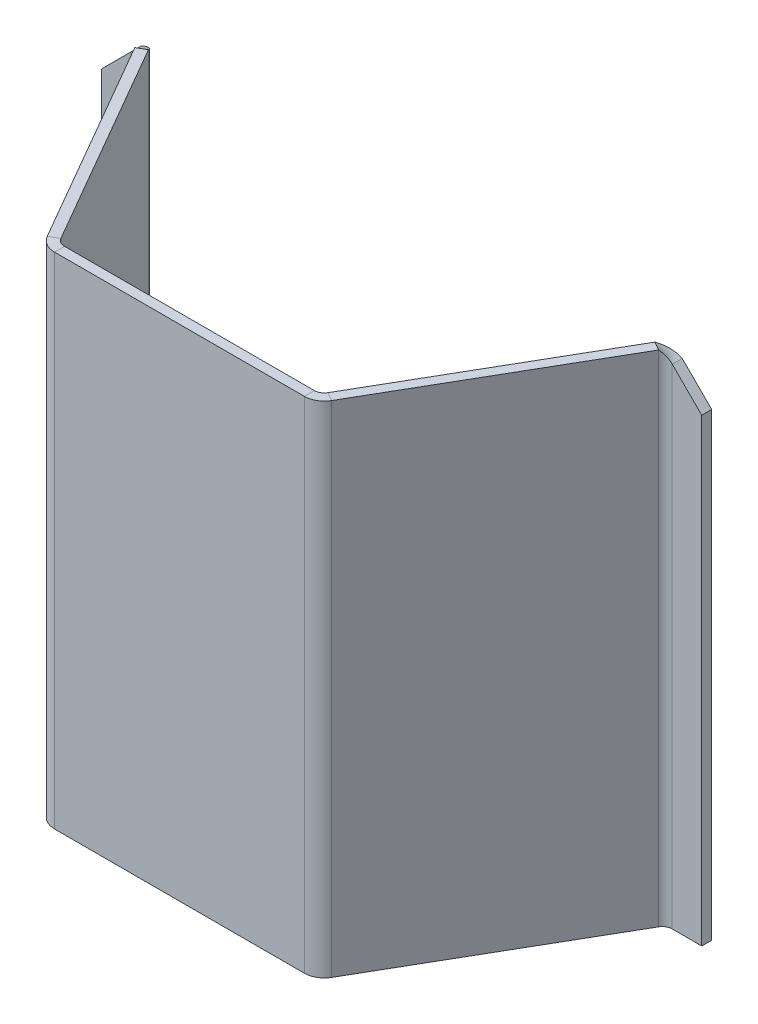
ISO-10303-21;
HEADER;
FILE_DESCRIPTION(('STEP AP214'),'2;1');
FILE_NAME('part.step','',(''),(''),'','','');
FILE_SCHEMA(('AUTOMOTIVE_DESIGN { 1 0 10303 214 1 1 1 1 }'));
ENDSEC;
DATA;
#1=APPLICATION_CONTEXT('core data for automotive mechanical design processes');
#2=APPLICATION_PROTOCOL_DEFINITION('international standard','automotive_design',2000,#1);
#3=PRODUCT_CONTEXT('',#1,'mechanical');
#4=PRODUCT('Part','Part','',(#3));
#5=PRODUCT_RELATED_PRODUCT_CATEGORY('part','',(#4));
#6=PRODUCT_DEFINITION_FORMATION('','',#4);
#7=PRODUCT_DEFINITION_CONTEXT('part definition',#1,'design');
#8=PRODUCT_DEFINITION('design','',#6,#7);
#9=PRODUCT_DEFINITION_SHAPE('','',#8);
#10=(LENGTH_UNIT() NAMED_UNIT(*) SI_UNIT(.MILLI.,.METRE.));
#11=(NAMED_UNIT(*) PLANE_ANGLE_UNIT() SI_UNIT($,.RADIAN.));
#12=(NAMED_UNIT(*) SI_UNIT($,.STERADIAN.) SOLID_ANGLE_UNIT());
#13=UNCERTAINTY_MEASURE_WITH_UNIT(LENGTH_MEASURE(1.E-05),#10,'distance_accuracy_value','');
#14=(GEOMETRIC_REPRESENTATION_CONTEXT(3) GLOBAL_UNCERTAINTY_ASSIGNED_CONTEXT((#13)) GLOBAL_UNIT_ASSIGNED_CONTEXT((#10,
#11,#12)) REPRESENTATION_CONTEXT('',''));
#15=CARTESIAN_POINT('',(0.,0.,0.));
#16=DIRECTION('',(0.,0.,1.));
#17=DIRECTION('',(1.,0.,0.));
#18=AXIS2_PLACEMENT_3D('',#15,#16,#17);
#19=CARTESIAN_POINT('',(79.,50.,1.));
#20=DIRECTION('',(0.,-1.,0.));
#21=DIRECTION('',(1.,0.,0.));
#22=AXIS2_PLACEMENT_3D('',#19,#20,#21);
#23=PLANE('',#22);
#24=DIRECTION('',(-1.,0.,0.));
#25=VECTOR('',#24,1.);
#26=CARTESIAN_POINT('',(79.,50.,0.));
#27=LINE('',#26,#25);
#28=CARTESIAN_POINT('',(54.,50.,0.));
#29=VERTEX_POINT('',#28);
#30=CARTESIAN_POINT('',(29.,50.,0.));
#31=VERTEX_POINT('',#30);
#32=EDGE_CURVE('E100',#29,#31,#27,.T.);
#33=ORIENTED_EDGE('',*,*,#32,.T.);
#34=DIRECTION('',(0.,0.,1.));
#35=VECTOR('',#34,1.);
#36=CARTESIAN_POINT('',(29.,50.,1.));
#37=LINE('',#36,#35);
#38=CARTESIAN_POINT('',(29.,50.,1.));
#39=VERTEX_POINT('',#38);
#40=EDGE_CURVE('E509',#31,#39,#37,.T.);
#41=ORIENTED_EDGE('',*,*,#40,.T.);
#42=DIRECTION('',(-1.,0.,0.));
#43=VECTOR('',#42,1.);
#44=CARTESIAN_POINT('',(79.,50.,1.));
#45=LINE('',#44,#43);
#46=CARTESIAN_POINT('',(54.,50.,0.999999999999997));
#47=VERTEX_POINT('',#46);
#48=EDGE_CURVE('E507',#47,#39,#45,.T.);
#49=ORIENTED_EDGE('',*,*,#48,.F.);
#50=DIRECTION('',(0.,0.,1.));
#51=VECTOR('',#50,1.);
#52=CARTESIAN_POINT('',(54.,50.,1.));
#53=LINE('',#52,#51);
#54=EDGE_CURVE('E510',#29,#47,#53,.T.);
#55=ORIENTED_EDGE('',*,*,#54,.F.);
#56=EDGE_LOOP('',(#33,#41,#49,#55));
#57=FACE_BOUND('',#56,.T.);
#58=ADVANCED_FACE('F75',(#57),#23,.F.);
#59=CARTESIAN_POINT('',(0.,0.,1.));
#60=DIRECTION('',(0.,1.,0.));
#61=DIRECTION('',(0.,0.,1.));
#62=AXIS2_PLACEMENT_3D('',#59,#60,#61);
#63=PLANE('',#62);
#64=DIRECTION('',(1.,0.,0.));
#65=VECTOR('',#64,1.);
#66=CARTESIAN_POINT('',(0.,0.,1.));
#67=LINE('',#66,#65);
#68=CARTESIAN_POINT('',(29.,0.,1.));
#69=VERTEX_POINT('',#68);
#70=CARTESIAN_POINT('',(54.,0.,1.));
#71=VERTEX_POINT('',#70);
#72=EDGE_CURVE('E497',#69,#71,#67,.T.);
#73=ORIENTED_EDGE('',*,*,#72,.F.);
#74=DIRECTION('',(0.,0.,-1.));
#75=VECTOR('',#74,1.);
#76=CARTESIAN_POINT('',(29.,0.,1.));
#77=LINE('',#76,#75);
#78=CARTESIAN_POINT('',(29.,0.,0.));
#79=VERTEX_POINT('',#78);
#80=EDGE_CURVE('E14',#69,#79,#77,.T.);
#81=ORIENTED_EDGE('',*,*,#80,.T.);
#82=DIRECTION('',(1.,0.,0.));
#83=VECTOR('',#82,1.);
#84=CARTESIAN_POINT('',(0.,0.,0.));
#85=LINE('',#84,#83);
#86=CARTESIAN_POINT('',(54.,0.,0.));
#87=VERTEX_POINT('',#86);
#88=EDGE_CURVE('E489',#79,#87,#85,.T.);
#89=ORIENTED_EDGE('',*,*,#88,.T.);
#90=DIRECTION('',(0.,0.,-1.));
#91=VECTOR('',#90,1.);
#92=CARTESIAN_POINT('',(54.,0.,1.));
#93=LINE('',#92,#91);
#94=EDGE_CURVE('E526',#71,#87,#93,.T.);
#95=ORIENTED_EDGE('',*,*,#94,.F.);
#96=EDGE_LOOP('',(#73,#81,#89,#95));
#97=FACE_BOUND('',#96,.T.);
#98=ADVANCED_FACE('F77',(#97),#63,.F.);
#99=CARTESIAN_POINT('',(0.,0.,0.));
#100=DIRECTION('',(0.,0.,1.));
#101=DIRECTION('',(1.,0.,0.));
#102=AXIS2_PLACEMENT_3D('',#99,#100,#101);
#103=PLANE('',#102);
#104=ORIENTED_EDGE('',*,*,#88,.F.);
#105=DIRECTION('',(0.,1.,0.));
#106=VECTOR('',#105,1.);
#107=CARTESIAN_POINT('',(29.,0.,0.));
#108=LINE('',#107,#106);
#109=EDGE_CURVE('E84',#79,#31,#108,.T.);
#110=ORIENTED_EDGE('',*,*,#109,.T.);
#111=ORIENTED_EDGE('',*,*,#32,.F.);
#112=DIRECTION('',(0.,1.,0.));
#113=VECTOR('',#112,1.);
#114=CARTESIAN_POINT('',(54.,0.,0.));
#115=LINE('',#114,#113);
#116=EDGE_CURVE('E491',#87,#29,#115,.T.);
#117=ORIENTED_EDGE('',*,*,#116,.F.);
#118=EDGE_LOOP('',(#104,#110,#111,#117));
#119=FACE_BOUND('',#118,.T.);
#120=ADVANCED_FACE('F479',(#119),#103,.F.);
#121=CARTESIAN_POINT('',(0.,0.,1.));
#122=DIRECTION('',(0.,0.,1.));
#123=DIRECTION('',(1.,0.,0.));
#124=AXIS2_PLACEMENT_3D('',#121,#122,#123);
#125=PLANE('',#124);
#126=DIRECTION('',(0.,1.,0.));
#127=VECTOR('',#126,1.);
#128=CARTESIAN_POINT('',(29.,0.,1.));
#129=LINE('',#128,#127);
#130=EDGE_CURVE('E503',#69,#39,#129,.T.);
#131=ORIENTED_EDGE('',*,*,#130,.F.);
#132=ORIENTED_EDGE('',*,*,#72,.T.);
#133=DIRECTION('',(0.,1.,0.));
#134=VECTOR('',#133,1.);
#135=CARTESIAN_POINT('',(54.,0.,1.));
#136=LINE('',#135,#134);
#137=EDGE_CURVE('E524',#71,#47,#136,.T.);
#138=ORIENTED_EDGE('',*,*,#137,.T.);
#139=ORIENTED_EDGE('',*,*,#48,.T.);
#140=EDGE_LOOP('',(#131,#132,#138,#139));
#141=FACE_BOUND('',#140,.T.);
#142=ADVANCED_FACE('F475',(#141),#125,.T.);
#143=CARTESIAN_POINT('',(54.,0.,-1.));
#144=DIRECTION('',(0.,-1.,0.));
#145=DIRECTION('',(1.,0.,0.));
#146=AXIS2_PLACEMENT_3D('',#143,#144,#145);
#147=PLANE('',#146);
#148=ORIENTED_EDGE('',*,*,#94,.T.);
#149=CARTESIAN_POINT('',(54.,0.,-1.));
#150=DIRECTION('',(0.,1.,0.));
#151=DIRECTION('',(-1.,0.,0.));
#152=AXIS2_PLACEMENT_3D('',#149,#150,#151);
#153=CIRCLE('',#152,1.);
#154=CARTESIAN_POINT('',(54.8660254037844,0.,-0.5));
#155=VERTEX_POINT('',#154);
#156=EDGE_CURVE('E438',#87,#155,#153,.T.);
#157=ORIENTED_EDGE('',*,*,#156,.T.);
#158=DIRECTION('',(-0.86602540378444,0.,-0.499999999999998));
#159=VECTOR('',#158,1.);
#160=CARTESIAN_POINT('',(55.7320508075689,0.,0.));
#161=LINE('',#160,#159);
#162=CARTESIAN_POINT('',(55.7320508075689,0.,0.));
#163=VERTEX_POINT('',#162);
#164=EDGE_CURVE('E598',#163,#155,#161,.T.);
#165=ORIENTED_EDGE('',*,*,#164,.F.);
#166=CARTESIAN_POINT('',(54.,0.,-1.));
#167=DIRECTION('',(0.,1.,0.));
#168=DIRECTION('',(-1.,0.,0.));
#169=AXIS2_PLACEMENT_3D('',#166,#167,#168);
#170=CIRCLE('',#169,2.);
#171=EDGE_CURVE('E533',#71,#163,#170,.T.);
#172=ORIENTED_EDGE('',*,*,#171,.F.);
#173=EDGE_LOOP('',(#148,#157,#165,#172));
#174=FACE_BOUND('',#173,.T.);
#175=ADVANCED_FACE('F471',(#174),#147,.T.);
#176=CARTESIAN_POINT('',(54.,50.,-1.));
#177=DIRECTION('',(0.,1.,0.));
#178=DIRECTION('',(0.,0.,1.));
#179=AXIS2_PLACEMENT_3D('',#176,#177,#178);
#180=PLANE('',#179);
#181=DIRECTION('',(0.86602540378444,0.,0.499999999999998));
#182=VECTOR('',#181,1.);
#183=CARTESIAN_POINT('',(55.7320508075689,50.,0.));
#184=LINE('',#183,#182);
#185=CARTESIAN_POINT('',(54.8660254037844,50.,-0.500000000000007));
#186=VERTEX_POINT('',#185);
#187=CARTESIAN_POINT('',(55.7320508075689,50.,0.));
#188=VERTEX_POINT('',#187);
#189=EDGE_CURVE('E431',#186,#188,#184,.T.);
#190=ORIENTED_EDGE('',*,*,#189,.F.);
#191=CARTESIAN_POINT('',(54.,50.,-1.));
#192=DIRECTION('',(0.,1.,0.));
#193=DIRECTION('',(-1.,0.,0.));
#194=AXIS2_PLACEMENT_3D('',#191,#192,#193);
#195=CIRCLE('',#194,1.);
#196=EDGE_CURVE('E530',#186,#29,#195,.F.);
#197=ORIENTED_EDGE('',*,*,#196,.T.);
#198=ORIENTED_EDGE('',*,*,#54,.T.);
#199=CARTESIAN_POINT('',(54.,50.,-1.));
#200=DIRECTION('',(0.,-1.,0.));
#201=DIRECTION('',(0.,0.,-1.));
#202=AXIS2_PLACEMENT_3D('',#199,#200,#201);
#203=CIRCLE('',#202,2.);
#204=EDGE_CURVE('E494',#188,#47,#203,.T.);
#205=ORIENTED_EDGE('',*,*,#204,.F.);
#206=EDGE_LOOP('',(#190,#197,#198,#205));
#207=FACE_BOUND('',#206,.T.);
#208=ADVANCED_FACE('F464',(#207),#180,.T.);
#209=CARTESIAN_POINT('',(54.,-25.0209620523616,-1.));
#210=DIRECTION('',(0.,1.,0.));
#211=DIRECTION('',(-1.,0.,0.));
#212=AXIS2_PLACEMENT_3D('',#209,#210,#211);
#213=CYLINDRICAL_SURFACE('',#212,2.);
#214=ORIENTED_EDGE('',*,*,#204,.T.);
#215=ORIENTED_EDGE('',*,*,#137,.F.);
#216=ORIENTED_EDGE('',*,*,#171,.T.);
#217=DIRECTION('',(0.,1.,0.));
#218=VECTOR('',#217,1.);
#219=CARTESIAN_POINT('',(55.7320508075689,0.,0.));
#220=LINE('',#219,#218);
#221=EDGE_CURVE('E335',#163,#188,#220,.T.);
#222=ORIENTED_EDGE('',*,*,#221,.T.);
#223=EDGE_LOOP('',(#214,#215,#216,#222));
#224=FACE_BOUND('',#223,.T.);
#225=ADVANCED_FACE('F460',(#224),#213,.T.);
#226=CARTESIAN_POINT('',(54.,-25.0209620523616,-1.));
#227=DIRECTION('',(0.,1.,0.));
#228=DIRECTION('',(-1.,0.,0.));
#229=AXIS2_PLACEMENT_3D('',#226,#227,#228);
#230=CYLINDRICAL_SURFACE('',#229,1.);
#231=ORIENTED_EDGE('',*,*,#196,.F.);
#232=DIRECTION('',(0.,1.,0.));
#233=VECTOR('',#232,1.);
#234=CARTESIAN_POINT('',(54.8660254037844,0.,-0.500000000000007));
#235=LINE('',#234,#233);
#236=EDGE_CURVE('E428',#155,#186,#235,.T.);
#237=ORIENTED_EDGE('',*,*,#236,.F.);
#238=ORIENTED_EDGE('',*,*,#156,.F.);
#239=ORIENTED_EDGE('',*,*,#116,.T.);
#240=EDGE_LOOP('',(#231,#237,#238,#239));
#241=FACE_BOUND('',#240,.T.);
#242=ADVANCED_FACE('F463',(#241),#230,.F.);
#243=CARTESIAN_POINT('',(71.5272641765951,0.,-21.2437263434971));
#244=DIRECTION('',(-1.,0.,0.));
#245=DIRECTION('',(0.,0.,1.));
#246=AXIS2_PLACEMENT_3D('',#243,#244,#245);
#247=PLANE('',#246);
#248=DIRECTION('',(0.,1.,0.));
#249=VECTOR('',#248,1.);
#250=CARTESIAN_POINT('',(71.5272641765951,0.,-22.2437263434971));
#251=LINE('',#250,#249);
#252=CARTESIAN_POINT('',(71.5272641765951,0.,-22.2437263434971));
#253=VERTEX_POINT('',#252);
#254=CARTESIAN_POINT('',(71.5272641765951,46.,-22.2437263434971));
#255=VERTEX_POINT('',#254);
#256=EDGE_CURVE('E541',#253,#255,#251,.T.);
#257=ORIENTED_EDGE('',*,*,#256,.T.);
#258=DIRECTION('',(0.,0.,-1.));
#259=VECTOR('',#258,1.);
#260=CARTESIAN_POINT('',(71.5272641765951,46.,-21.2437263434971));
#261=LINE('',#260,#259);
#262=CARTESIAN_POINT('',(71.5272641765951,46.,-21.2437263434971));
#263=VERTEX_POINT('',#262);
#264=EDGE_CURVE('E550',#263,#255,#261,.T.);
#265=ORIENTED_EDGE('',*,*,#264,.F.);
#266=DIRECTION('',(0.,1.,0.));
#267=VECTOR('',#266,1.);
#268=CARTESIAN_POINT('',(71.5272641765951,0.,-21.2437263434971));
#269=LINE('',#268,#267);
#270=CARTESIAN_POINT('',(71.5272641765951,0.,-21.2437263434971));
#271=VERTEX_POINT('',#270);
#272=EDGE_CURVE('E565',#271,#263,#269,.T.);
#273=ORIENTED_EDGE('',*,*,#272,.F.);
#274=DIRECTION('',(0.,0.,-1.));
#275=VECTOR('',#274,1.);
#276=CARTESIAN_POINT('',(71.5272641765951,0.,-21.2437263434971));
#277=LINE('',#276,#275);
#278=EDGE_CURVE('E543',#271,#253,#277,.T.);
#279=ORIENTED_EDGE('',*,*,#278,.T.);
#280=EDGE_LOOP('',(#257,#265,#273,#279));
#281=FACE_BOUND('',#280,.T.);
#282=ADVANCED_FACE('F361',(#281),#247,.F.);
#283=CARTESIAN_POINT('',(71.5272641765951,46.,-21.2437263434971));
#284=DIRECTION('',(-0.707106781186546,-0.707106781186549,0.));
#285=DIRECTION('',(0.707106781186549,-0.707106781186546,0.));
#286=AXIS2_PLACEMENT_3D('',#283,#284,#285);
#287=PLANE('',#286);
#288=DIRECTION('',(-0.707106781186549,0.707106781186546,0.));
#289=VECTOR('',#288,1.);
#290=CARTESIAN_POINT('',(71.5272641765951,46.,-22.2437263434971));
#291=LINE('',#290,#289);
#292=CARTESIAN_POINT('',(68.5744721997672,48.9527919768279,-22.2437263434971));
#293=VERTEX_POINT('',#292);
#294=EDGE_CURVE('E546',#255,#293,#291,.T.);
#295=ORIENTED_EDGE('',*,*,#294,.T.);
#296=CARTESIAN_POINT('',(68.5744721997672,48.9527919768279,-21.2437263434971));
#297=CARTESIAN_POINT('',(68.5744721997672,48.9527919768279,-22.2437263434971));
#298=B_SPLINE_CURVE_WITH_KNOTS('',1,(#296,#297),.UNSPECIFIED.,.F.,.F.,(2,2),(0.,1.),.UNSPECIFIED.);
#299=CARTESIAN_POINT('',(68.5744721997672,48.9527919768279,-21.2437263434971));
#300=VERTEX_POINT('',#299);
#301=EDGE_CURVE('E343',#293,#300,#298,.F.);
#302=ORIENTED_EDGE('',*,*,#301,.T.);
#303=DIRECTION('',(-0.707106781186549,0.707106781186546,0.));
#304=VECTOR('',#303,1.);
#305=CARTESIAN_POINT('',(71.5272641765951,46.,-21.2437263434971));
#306=LINE('',#305,#304);
#307=EDGE_CURVE('E421',#263,#300,#306,.T.);
#308=ORIENTED_EDGE('',*,*,#307,.F.);
#309=ORIENTED_EDGE('',*,*,#264,.T.);
#310=EDGE_LOOP('',(#295,#302,#308,#309));
#311=FACE_BOUND('',#310,.T.);
#312=ADVANCED_FACE('F350',(#311),#287,.F.);
#313=CARTESIAN_POINT('',(-11.4727358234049,0.,-22.2437263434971));
#314=DIRECTION('',(0.,0.,1.));
#315=DIRECTION('',(1.,0.,0.));
#316=AXIS2_PLACEMENT_3D('',#313,#314,#315);
#317=PLANE('',#316);
#318=DIRECTION('',(1.,0.,0.));
#319=VECTOR('',#318,1.);
#320=CARTESIAN_POINT('',(-11.4727358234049,0.,-22.2437263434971));
#321=LINE('',#320,#319);
#322=CARTESIAN_POINT('',(68.5744721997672,0.,-22.2437263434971));
#323=VERTEX_POINT('',#322);
#324=EDGE_CURVE('E561',#323,#253,#321,.T.);
#325=ORIENTED_EDGE('',*,*,#324,.F.);
#326=DIRECTION('',(0.,1.,0.));
#327=VECTOR('',#326,1.);
#328=CARTESIAN_POINT('',(68.5744721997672,0.,-22.2437263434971));
#329=LINE('',#328,#327);
#330=EDGE_CURVE('E553',#323,#293,#329,.T.);
#331=ORIENTED_EDGE('',*,*,#330,.T.);
#332=ORIENTED_EDGE('',*,*,#294,.F.);
#333=ORIENTED_EDGE('',*,*,#256,.F.);
#334=EDGE_LOOP('',(#325,#331,#332,#333));
#335=FACE_BOUND('',#334,.T.);
#336=ADVANCED_FACE('F360',(#335),#317,.F.);
#337=CARTESIAN_POINT('',(-11.4727358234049,0.,-21.2437263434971));
#338=DIRECTION('',(0.,1.,0.));
#339=DIRECTION('',(0.,0.,1.));
#340=AXIS2_PLACEMENT_3D('',#337,#338,#339);
#341=PLANE('',#340);
#342=DIRECTION('',(1.,0.,0.));
#343=VECTOR('',#342,1.);
#344=CARTESIAN_POINT('',(-11.4727358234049,0.,-21.2437263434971));
#345=LINE('',#344,#343);
#346=CARTESIAN_POINT('',(68.5744721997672,0.,-21.2437263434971));
#347=VERTEX_POINT('',#346);
#348=EDGE_CURVE('E563',#347,#271,#345,.T.);
#349=ORIENTED_EDGE('',*,*,#348,.F.);
#350=DIRECTION('',(0.,0.,-1.));
#351=VECTOR('',#350,1.);
#352=CARTESIAN_POINT('',(68.5744721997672,0.,-21.2437263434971));
#353=LINE('',#352,#351);
#354=EDGE_CURVE('E558',#347,#323,#353,.T.);
#355=ORIENTED_EDGE('',*,*,#354,.T.);
#356=ORIENTED_EDGE('',*,*,#324,.T.);
#357=ORIENTED_EDGE('',*,*,#278,.F.);
#358=EDGE_LOOP('',(#349,#355,#356,#357));
#359=FACE_BOUND('',#358,.T.);
#360=ADVANCED_FACE('F365',(#359),#341,.F.);
#361=CARTESIAN_POINT('',(-11.4727358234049,0.,-21.2437263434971));
#362=DIRECTION('',(0.,0.,1.));
#363=DIRECTION('',(1.,0.,0.));
#364=AXIS2_PLACEMENT_3D('',#361,#362,#363);
#365=PLANE('',#364);
#366=DIRECTION('',(0.,1.,0.));
#367=VECTOR('',#366,1.);
#368=CARTESIAN_POINT('',(68.5744721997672,0.,-21.2437263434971));
#369=LINE('',#368,#367);
#370=EDGE_CURVE('E583',#347,#300,#369,.T.);
#371=ORIENTED_EDGE('',*,*,#370,.F.);
#372=ORIENTED_EDGE('',*,*,#348,.T.);
#373=ORIENTED_EDGE('',*,*,#272,.T.);
#374=ORIENTED_EDGE('',*,*,#307,.T.);
#375=EDGE_LOOP('',(#371,#372,#373,#374));
#376=FACE_BOUND('',#375,.T.);
#377=ADVANCED_FACE('F369',(#376),#365,.T.);
#378=CARTESIAN_POINT('',(68.5744721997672,48.9527919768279,-22.2437263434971));
#379=CARTESIAN_POINT('',(68.2252483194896,49.1274056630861,-22.2437263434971));
#380=CARTESIAN_POINT('',(67.8767720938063,49.3018613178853,-22.1503100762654));
#381=CARTESIAN_POINT('',(67.2721723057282,49.6509306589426,-21.8012442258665));
#382=CARTESIAN_POINT('',(67.0170333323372,49.8253863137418,-21.5461630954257));
#383=CARTESIAN_POINT('',(66.8424213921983,50.,-21.2437263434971));
#384=CARTESIAN_POINT('',(68.5744721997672,48.9527919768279,-21.2437263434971));
#385=CARTESIAN_POINT('',(68.399889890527,49.1273760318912,-21.2437263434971));
#386=CARTESIAN_POINT('',(68.2256221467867,49.3018613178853,-21.1970182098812));
#387=CARTESIAN_POINT('',(67.9233222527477,49.6509306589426,-21.0224852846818));
#388=CARTESIAN_POINT('',(67.7957379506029,49.8254159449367,-20.8949190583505));
#389=CARTESIAN_POINT('',(67.7084467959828,50.,-20.7437263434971));
#390=B_SPLINE_SURFACE_WITH_KNOTS('',1,3,((#378,#379,#380,#381,#382,#383),(#384,#385,#386,#387,
#388,#389)),.UNSPECIFIED.,.F.,.F.,.F.,(2,2),(4,2,4),(0.,1.),(0.,0.5,1.),.UNSPECIFIED.);
#391=CARTESIAN_POINT('',(68.5744721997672,48.9527919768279,-22.2437263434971));
#392=CARTESIAN_POINT('',(68.2252483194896,49.1274056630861,-22.2437263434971));
#393=CARTESIAN_POINT('',(67.8767720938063,49.3018613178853,-22.1503100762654));
#394=CARTESIAN_POINT('',(67.2721723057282,49.6509306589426,-21.8012442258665));
#395=CARTESIAN_POINT('',(67.0170333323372,49.8253863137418,-21.5461630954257));
#396=CARTESIAN_POINT('',(66.8424213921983,50.,-21.2437263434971));
#397=B_SPLINE_CURVE_WITH_KNOTS('',3,(#391,#392,#393,#394,#395,#396),.UNSPECIFIED.,.F.,.F.,(4,2,
4),(0.,0.5,1.),.UNSPECIFIED.);
#398=CARTESIAN_POINT('',(66.8424213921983,50.,-21.2437263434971));
#399=VERTEX_POINT('',#398);
#400=EDGE_CURVE('E412',#293,#399,#397,.T.);
#401=CARTESIAN_POINT('',(66.8424213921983,50.,-21.2437263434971));
#402=CARTESIAN_POINT('',(67.7084467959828,50.,-20.7437263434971));
#403=B_SPLINE_CURVE_WITH_KNOTS('',1,(#401,#402),.UNSPECIFIED.,.F.,.F.,(2,2),(0.,1.),.UNSPECIFIED.);
#404=CARTESIAN_POINT('',(67.7084467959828,50.,-20.7437263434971));
#405=VERTEX_POINT('',#404);
#406=EDGE_CURVE('E416',#405,#399,#403,.F.);
#407=CARTESIAN_POINT('',(67.7084467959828,50.,-20.7437263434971));
#408=CARTESIAN_POINT('',(67.7957379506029,49.8254159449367,-20.8949190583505));
#409=CARTESIAN_POINT('',(67.9233222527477,49.6509306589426,-21.0224852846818));
#410=CARTESIAN_POINT('',(68.2256221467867,49.3018613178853,-21.1970182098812));
#411=CARTESIAN_POINT('',(68.399889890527,49.1273760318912,-21.2437263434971));
#412=CARTESIAN_POINT('',(68.5744721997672,48.9527919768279,-21.2437263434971));
#413=B_SPLINE_CURVE_WITH_KNOTS('',3,(#407,#408,#409,#410,#411,#412),.UNSPECIFIED.,.F.,.F.,(4,2,
4),(0.,0.5,1.),.UNSPECIFIED.);
#414=EDGE_CURVE('E579',#300,#405,#413,.F.);
#415=ORIENTED_EDGE('',*,*,#301,.F.);
#416=ORIENTED_EDGE('',*,*,#400,.T.);
#417=ORIENTED_EDGE('',*,*,#406,.F.);
#418=ORIENTED_EDGE('',*,*,#414,.F.);
#419=EDGE_LOOP('',(#415,#416,#417,#418));
#420=FACE_BOUND('',#419,.T.);
#421=ADVANCED_FACE('F373',(#420),#390,.F.);
#422=CARTESIAN_POINT('',(68.5744721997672,-25.0209620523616,-20.2437263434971));
#423=DIRECTION('',(0.,1.,0.));
#424=DIRECTION('',(0.86602540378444,0.,0.499999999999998));
#425=AXIS2_PLACEMENT_3D('',#422,#423,#424);
#426=CYLINDRICAL_SURFACE('',#425,2.);
#427=ORIENTED_EDGE('',*,*,#400,.F.);
#428=ORIENTED_EDGE('',*,*,#330,.F.);
#429=CARTESIAN_POINT('',(68.5744721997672,0.,-20.2437263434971));
#430=DIRECTION('',(0.,1.,0.));
#431=DIRECTION('',(0.86602540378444,0.,0.499999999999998));
#432=AXIS2_PLACEMENT_3D('',#429,#430,#431);
#433=CIRCLE('',#432,2.);
#434=CARTESIAN_POINT('',(66.8424213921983,0.,-21.2437263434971));
#435=VERTEX_POINT('',#434);
#436=EDGE_CURVE('E576',#435,#323,#433,.F.);
#437=ORIENTED_EDGE('',*,*,#436,.F.);
#438=DIRECTION('',(0.,1.,0.));
#439=VECTOR('',#438,1.);
#440=CARTESIAN_POINT('',(66.8424213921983,0.,-21.2437263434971));
#441=LINE('',#440,#439);
#442=EDGE_CURVE('E420',#435,#399,#441,.T.);
#443=ORIENTED_EDGE('',*,*,#442,.T.);
#444=EDGE_LOOP('',(#427,#428,#437,#443));
#445=FACE_BOUND('',#444,.T.);
#446=ADVANCED_FACE('F380',(#445),#426,.T.);
#447=CARTESIAN_POINT('',(68.5744721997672,0.,-20.2437263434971));
#448=DIRECTION('',(0.,1.,0.));
#449=DIRECTION('',(0.86602540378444,0.,0.499999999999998));
#450=AXIS2_PLACEMENT_3D('',#447,#448,#449);
#451=PLANE('',#450);
#452=DIRECTION('',(-0.86602540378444,0.,-0.499999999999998));
#453=VECTOR('',#452,1.);
#454=CARTESIAN_POINT('',(67.7084467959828,0.,-20.7437263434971));
#455=LINE('',#454,#453);
#456=CARTESIAN_POINT('',(67.7084467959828,0.,-20.7437263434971));
#457=VERTEX_POINT('',#456);
#458=EDGE_CURVE('E573',#457,#435,#455,.T.);
#459=ORIENTED_EDGE('',*,*,#458,.T.);
#460=ORIENTED_EDGE('',*,*,#436,.T.);
#461=ORIENTED_EDGE('',*,*,#354,.F.);
#462=CARTESIAN_POINT('',(68.5744721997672,0.,-20.2437263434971));
#463=DIRECTION('',(0.,-1.,0.));
#464=DIRECTION('',(-0.86602540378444,0.,-0.499999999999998));
#465=AXIS2_PLACEMENT_3D('',#462,#463,#464);
#466=CIRCLE('',#465,1.);
#467=EDGE_CURVE('E580',#457,#347,#466,.T.);
#468=ORIENTED_EDGE('',*,*,#467,.F.);
#469=EDGE_LOOP('',(#459,#460,#461,#468));
#470=FACE_BOUND('',#469,.T.);
#471=ADVANCED_FACE('F612',(#470),#451,.F.);
#472=CARTESIAN_POINT('',(68.5744721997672,-25.0209620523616,-20.2437263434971));
#473=DIRECTION('',(0.,1.,0.));
#474=DIRECTION('',(0.86602540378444,0.,0.499999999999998));
#475=AXIS2_PLACEMENT_3D('',#472,#473,#474);
#476=CYLINDRICAL_SURFACE('',#475,1.);
#477=ORIENTED_EDGE('',*,*,#414,.T.);
#478=DIRECTION('',(0.,1.,0.));
#479=VECTOR('',#478,1.);
#480=CARTESIAN_POINT('',(67.7084467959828,0.,-20.7437263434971));
#481=LINE('',#480,#479);
#482=EDGE_CURVE('E590',#457,#405,#481,.T.);
#483=ORIENTED_EDGE('',*,*,#482,.F.);
#484=ORIENTED_EDGE('',*,*,#467,.T.);
#485=ORIENTED_EDGE('',*,*,#370,.T.);
#486=EDGE_LOOP('',(#477,#483,#484,#485));
#487=FACE_BOUND('',#486,.T.);
#488=ADVANCED_FACE('F620',(#487),#476,.F.);
#489=CARTESIAN_POINT('',(28.2084467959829,0.,47.6722805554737));
#490=DIRECTION('',(0.86602540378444,0.,0.499999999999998));
#491=DIRECTION('',(0.499999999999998,0.,-0.86602540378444));
#492=AXIS2_PLACEMENT_3D('',#489,#490,#491);
#493=PLANE('',#492);
#494=ORIENTED_EDGE('',*,*,#221,.F.);
#495=DIRECTION('',(0.499999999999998,0.,-0.86602540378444));
#496=VECTOR('',#495,1.);
#497=CARTESIAN_POINT('',(28.2084467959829,0.,47.6722805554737));
#498=LINE('',#497,#496);
#499=EDGE_CURVE('E588',#163,#457,#498,.T.);
#500=ORIENTED_EDGE('',*,*,#499,.T.);
#501=ORIENTED_EDGE('',*,*,#482,.T.);
#502=DIRECTION('',(-0.499999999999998,0.,0.86602540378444));
#503=VECTOR('',#502,1.);
#504=CARTESIAN_POINT('',(67.7084467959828,50.,-20.7437263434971));
#505=LINE('',#504,#503);
#506=EDGE_CURVE('E437',#405,#188,#505,.T.);
#507=ORIENTED_EDGE('',*,*,#506,.T.);
#508=EDGE_LOOP('',(#494,#500,#501,#507));
#509=FACE_BOUND('',#508,.T.);
#510=ADVANCED_FACE('F622',(#509),#493,.T.);
#511=CARTESIAN_POINT('',(28.2084467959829,0.,47.6722805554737));
#512=DIRECTION('',(0.,1.,0.));
#513=DIRECTION('',(0.86602540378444,0.,0.499999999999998));
#514=AXIS2_PLACEMENT_3D('',#511,#512,#513);
#515=PLANE('',#514);
#516=ORIENTED_EDGE('',*,*,#499,.F.);
#517=ORIENTED_EDGE('',*,*,#164,.T.);
#518=DIRECTION('',(0.499999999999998,0.,-0.86602540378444));
#519=VECTOR('',#518,1.);
#520=CARTESIAN_POINT('',(27.3424213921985,0.,47.1722805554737));
#521=LINE('',#520,#519);
#522=EDGE_CURVE('E601',#155,#435,#521,.T.);
#523=ORIENTED_EDGE('',*,*,#522,.T.);
#524=ORIENTED_EDGE('',*,*,#458,.F.);
#525=EDGE_LOOP('',(#516,#517,#523,#524));
#526=FACE_BOUND('',#525,.T.);
#527=ADVANCED_FACE('F608',(#526),#515,.F.);
#528=CARTESIAN_POINT('',(27.3424213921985,0.,47.1722805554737));
#529=DIRECTION('',(0.86602540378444,0.,0.499999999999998));
#530=DIRECTION('',(0.499999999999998,0.,-0.86602540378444));
#531=AXIS2_PLACEMENT_3D('',#528,#529,#530);
#532=PLANE('',#531);
#533=ORIENTED_EDGE('',*,*,#522,.F.);
#534=ORIENTED_EDGE('',*,*,#236,.T.);
#535=DIRECTION('',(-0.499999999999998,0.,0.86602540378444));
#536=VECTOR('',#535,1.);
#537=CARTESIAN_POINT('',(66.8424213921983,50.,-21.2437263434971));
#538=LINE('',#537,#536);
#539=EDGE_CURVE('E425',#399,#186,#538,.T.);
#540=ORIENTED_EDGE('',*,*,#539,.F.);
#541=ORIENTED_EDGE('',*,*,#442,.F.);
#542=EDGE_LOOP('',(#533,#534,#540,#541));
#543=FACE_BOUND('',#542,.T.);
#544=ADVANCED_FACE('F426',(#543),#532,.F.);
#545=CARTESIAN_POINT('',(67.7084467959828,50.,-20.7437263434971));
#546=DIRECTION('',(0.,-1.,0.));
#547=DIRECTION('',(0.499999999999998,0.,-0.86602540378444));
#548=AXIS2_PLACEMENT_3D('',#545,#546,#547);
#549=PLANE('',#548);
#550=ORIENTED_EDGE('',*,*,#539,.T.);
#551=ORIENTED_EDGE('',*,*,#189,.T.);
#552=ORIENTED_EDGE('',*,*,#506,.F.);
#553=ORIENTED_EDGE('',*,*,#406,.T.);
#554=EDGE_LOOP('',(#550,#551,#552,#553));
#555=FACE_BOUND('',#554,.T.);
#556=ADVANCED_FACE('F435',(#555),#549,.F.);
#557=CARTESIAN_POINT('',(29.,0.,-1.));
#558=DIRECTION('',(0.,-1.,0.));
#559=DIRECTION('',(1.,0.,0.));
#560=AXIS2_PLACEMENT_3D('',#557,#558,#559);
#561=PLANE('',#560);
#562=DIRECTION('',(0.86602540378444,0.,-0.499999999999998));
#563=VECTOR('',#562,1.);
#564=CARTESIAN_POINT('',(27.2679491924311,0.,0.));
#565=LINE('',#564,#563);
#566=CARTESIAN_POINT('',(27.2679491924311,0.,0.));
#567=VERTEX_POINT('',#566);
#568=CARTESIAN_POINT('',(28.1339745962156,0.,-0.5));
#569=VERTEX_POINT('',#568);
#570=EDGE_CURVE('E326',#567,#569,#565,.T.);
#571=ORIENTED_EDGE('',*,*,#570,.T.);
#572=CARTESIAN_POINT('',(29.,0.,-1.));
#573=DIRECTION('',(0.,-1.,0.));
#574=DIRECTION('',(1.,0.,0.));
#575=AXIS2_PLACEMENT_3D('',#572,#573,#574);
#576=CIRCLE('',#575,1.);
#577=EDGE_CURVE('E92',#569,#79,#576,.F.);
#578=ORIENTED_EDGE('',*,*,#577,.T.);
#579=ORIENTED_EDGE('',*,*,#80,.F.);
#580=CARTESIAN_POINT('',(29.,0.,-1.));
#581=DIRECTION('',(0.,1.,0.));
#582=DIRECTION('',(-1.,0.,0.));
#583=AXIS2_PLACEMENT_3D('',#580,#581,#582);
#584=CIRCLE('',#583,2.);
#585=EDGE_CURVE('E328',#567,#69,#584,.T.);
#586=ORIENTED_EDGE('',*,*,#585,.F.);
#587=EDGE_LOOP('',(#571,#578,#579,#586));
#588=FACE_BOUND('',#587,.T.);
#589=ADVANCED_FACE('F458',(#588),#561,.T.);
#590=CARTESIAN_POINT('',(29.,50.,-1.));
#591=DIRECTION('',(0.,1.,0.));
#592=DIRECTION('',(0.,0.,1.));
#593=AXIS2_PLACEMENT_3D('',#590,#591,#592);
#594=PLANE('',#593);
#595=CARTESIAN_POINT('',(29.,50.,-1.));
#596=DIRECTION('',(0.,-1.,0.));
#597=DIRECTION('',(1.,0.,0.));
#598=AXIS2_PLACEMENT_3D('',#595,#596,#597);
#599=CIRCLE('',#598,1.);
#600=CARTESIAN_POINT('',(28.1339745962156,50.,-0.5));
#601=VERTEX_POINT('',#600);
#602=EDGE_CURVE('E332',#31,#601,#599,.T.);
#603=ORIENTED_EDGE('',*,*,#602,.T.);
#604=DIRECTION('',(-0.86602540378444,0.,0.499999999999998));
#605=VECTOR('',#604,1.);
#606=CARTESIAN_POINT('',(27.2679491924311,50.,0.));
#607=LINE('',#606,#605);
#608=CARTESIAN_POINT('',(27.2679491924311,50.,0.));
#609=VERTEX_POINT('',#608);
#610=EDGE_CURVE('E224',#601,#609,#607,.T.);
#611=ORIENTED_EDGE('',*,*,#610,.T.);
#612=CARTESIAN_POINT('',(29.,50.,-1.));
#613=DIRECTION('',(0.,-1.,0.));
#614=DIRECTION('',(0.,0.,-1.));
#615=AXIS2_PLACEMENT_3D('',#612,#613,#614);
#616=CIRCLE('',#615,2.);
#617=EDGE_CURVE('E331',#39,#609,#616,.T.);
#618=ORIENTED_EDGE('',*,*,#617,.F.);
#619=ORIENTED_EDGE('',*,*,#40,.F.);
#620=EDGE_LOOP('',(#603,#611,#618,#619));
#621=FACE_BOUND('',#620,.T.);
#622=ADVANCED_FACE('F628',(#621),#594,.T.);
#623=CARTESIAN_POINT('',(29.,75.0209620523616,-1.));
#624=DIRECTION('',(0.,-1.,0.));
#625=DIRECTION('',(1.,0.,0.));
#626=AXIS2_PLACEMENT_3D('',#623,#624,#625);
#627=CYLINDRICAL_SURFACE('',#626,2.);
#628=ORIENTED_EDGE('',*,*,#130,.T.);
#629=ORIENTED_EDGE('',*,*,#617,.T.);
#630=DIRECTION('',(0.,1.,0.));
#631=VECTOR('',#630,1.);
#632=CARTESIAN_POINT('',(27.2679491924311,0.,0.));
#633=LINE('',#632,#631);
#634=EDGE_CURVE('E272',#567,#609,#633,.T.);
#635=ORIENTED_EDGE('',*,*,#634,.F.);
#636=ORIENTED_EDGE('',*,*,#585,.T.);
#637=EDGE_LOOP('',(#628,#629,#635,#636));
#638=FACE_BOUND('',#637,.T.);
#639=ADVANCED_FACE('F502',(#638),#627,.T.);
#640=CARTESIAN_POINT('',(29.,75.0209620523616,-1.));
#641=DIRECTION('',(0.,-1.,0.));
#642=DIRECTION('',(1.,0.,0.));
#643=AXIS2_PLACEMENT_3D('',#640,#641,#642);
#644=CYLINDRICAL_SURFACE('',#643,1.);
#645=ORIENTED_EDGE('',*,*,#109,.F.);
#646=ORIENTED_EDGE('',*,*,#577,.F.);
#647=DIRECTION('',(0.,1.,0.));
#648=VECTOR('',#647,1.);
#649=CARTESIAN_POINT('',(28.1339745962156,0.,-0.5));
#650=LINE('',#649,#648);
#651=EDGE_CURVE('E324',#569,#601,#650,.T.);
#652=ORIENTED_EDGE('',*,*,#651,.T.);
#653=ORIENTED_EDGE('',*,*,#602,.F.);
#654=EDGE_LOOP('',(#645,#646,#652,#653));
#655=FACE_BOUND('',#654,.T.);
#656=ADVANCED_FACE('F630',(#655),#644,.F.);
#657=CARTESIAN_POINT('',(11.4727358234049,46.,-21.2437263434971));
#658=DIRECTION('',(1.,0.,0.));
#659=DIRECTION('',(0.,1.,0.));
#660=AXIS2_PLACEMENT_3D('',#657,#658,#659);
#661=PLANE('',#660);
#662=DIRECTION('',(0.,-1.,0.));
#663=VECTOR('',#662,1.);
#664=CARTESIAN_POINT('',(11.4727358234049,46.,-22.2437263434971));
#665=LINE('',#664,#663);
#666=CARTESIAN_POINT('',(11.4727358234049,46.,-22.2437263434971));
#667=VERTEX_POINT('',#666);
#668=CARTESIAN_POINT('',(11.4727358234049,0.,-22.2437263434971));
#669=VERTEX_POINT('',#668);
#670=EDGE_CURVE('E320',#667,#669,#665,.T.);
#671=ORIENTED_EDGE('',*,*,#670,.T.);
#672=DIRECTION('',(0.,0.,-1.));
#673=VECTOR('',#672,1.);
#674=CARTESIAN_POINT('',(11.4727358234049,0.,-21.2437263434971));
#675=LINE('',#674,#673);
#676=CARTESIAN_POINT('',(11.4727358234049,0.,-21.2437263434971));
#677=VERTEX_POINT('',#676);
#678=EDGE_CURVE('E314',#677,#669,#675,.T.);
#679=ORIENTED_EDGE('',*,*,#678,.F.);
#680=DIRECTION('',(0.,-1.,0.));
#681=VECTOR('',#680,1.);
#682=CARTESIAN_POINT('',(11.4727358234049,46.,-21.2437263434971));
#683=LINE('',#682,#681);
#684=CARTESIAN_POINT('',(11.4727358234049,46.,-21.2437263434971));
#685=VERTEX_POINT('',#684);
#686=EDGE_CURVE('E294',#685,#677,#683,.T.);
#687=ORIENTED_EDGE('',*,*,#686,.F.);
#688=DIRECTION('',(0.,0.,-1.));
#689=VECTOR('',#688,1.);
#690=CARTESIAN_POINT('',(11.4727358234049,46.,-21.2437263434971));
#691=LINE('',#690,#689);
#692=EDGE_CURVE('E317',#685,#667,#691,.T.);
#693=ORIENTED_EDGE('',*,*,#692,.T.);
#694=EDGE_LOOP('',(#671,#679,#687,#693));
#695=FACE_BOUND('',#694,.T.);
#696=ADVANCED_FACE('F653',(#695),#661,.F.);
#697=CARTESIAN_POINT('',(11.4727358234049,0.,-21.2437263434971));
#698=DIRECTION('',(0.,1.,0.));
#699=DIRECTION('',(0.,0.,1.));
#700=AXIS2_PLACEMENT_3D('',#697,#698,#699);
#701=PLANE('',#700);
#702=DIRECTION('',(0.,0.,-1.));
#703=VECTOR('',#702,1.);
#704=CARTESIAN_POINT('',(14.4255278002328,0.,-21.2437263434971));
#705=LINE('',#704,#703);
#706=CARTESIAN_POINT('',(14.4255278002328,0.,-21.2437263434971));
#707=VERTEX_POINT('',#706);
#708=CARTESIAN_POINT('',(14.4255278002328,0.,-22.2437263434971));
#709=VERTEX_POINT('',#708);
#710=EDGE_CURVE('E291',#707,#709,#705,.T.);
#711=ORIENTED_EDGE('',*,*,#710,.F.);
#712=DIRECTION('',(1.,0.,0.));
#713=VECTOR('',#712,1.);
#714=CARTESIAN_POINT('',(11.4727358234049,0.,-21.2437263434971));
#715=LINE('',#714,#713);
#716=EDGE_CURVE('E303',#677,#707,#715,.T.);
#717=ORIENTED_EDGE('',*,*,#716,.F.);
#718=ORIENTED_EDGE('',*,*,#678,.T.);
#719=DIRECTION('',(1.,0.,0.));
#720=VECTOR('',#719,1.);
#721=CARTESIAN_POINT('',(11.4727358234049,0.,-22.2437263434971));
#722=LINE('',#721,#720);
#723=EDGE_CURVE('E310',#669,#709,#722,.T.);
#724=ORIENTED_EDGE('',*,*,#723,.T.);
#725=EDGE_LOOP('',(#711,#717,#718,#724));
#726=FACE_BOUND('',#725,.T.);
#727=ADVANCED_FACE('F645',(#726),#701,.F.);
#728=CARTESIAN_POINT('',(11.4727358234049,0.,-22.2437263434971));
#729=DIRECTION('',(0.,0.,1.));
#730=DIRECTION('',(1.,0.,0.));
#731=AXIS2_PLACEMENT_3D('',#728,#729,#730);
#732=PLANE('',#731);
#733=DIRECTION('',(0.,1.,0.));
#734=VECTOR('',#733,1.);
#735=CARTESIAN_POINT('',(14.4255278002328,0.,-22.2437263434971));
#736=LINE('',#735,#734);
#737=CARTESIAN_POINT('',(14.4255278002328,48.9527919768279,-22.2437263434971));
#738=VERTEX_POINT('',#737);
#739=EDGE_CURVE('E256',#709,#738,#736,.T.);
#740=ORIENTED_EDGE('',*,*,#739,.F.);
#741=ORIENTED_EDGE('',*,*,#723,.F.);
#742=ORIENTED_EDGE('',*,*,#670,.F.);
#743=DIRECTION('',(-0.707106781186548,-0.707106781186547,0.));
#744=VECTOR('',#743,1.);
#745=CARTESIAN_POINT('',(15.4727358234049,50.,-22.2437263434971));
#746=LINE('',#745,#744);
#747=EDGE_CURVE('E308',#738,#667,#746,.T.);
#748=ORIENTED_EDGE('',*,*,#747,.F.);
#749=EDGE_LOOP('',(#740,#741,#742,#748));
#750=FACE_BOUND('',#749,.T.);
#751=ADVANCED_FACE('F656',(#750),#732,.F.);
#752=CARTESIAN_POINT('',(15.4727358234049,50.,-21.2437263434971));
#753=DIRECTION('',(0.707106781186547,-0.707106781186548,0.));
#754=DIRECTION('',(0.707106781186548,0.707106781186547,0.));
#755=AXIS2_PLACEMENT_3D('',#752,#753,#754);
#756=PLANE('',#755);
#757=CARTESIAN_POINT('',(14.4255278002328,48.9527919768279,-22.2437263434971));
#758=CARTESIAN_POINT('',(14.4255278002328,48.9527919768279,-21.2437263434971));
#759=B_SPLINE_CURVE_WITH_KNOTS('',1,(#757,#758),.UNSPECIFIED.,.F.,.F.,(2,2),(0.,1.),.UNSPECIFIED.);
#760=CARTESIAN_POINT('',(14.4255278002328,48.9527919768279,-21.2437263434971));
#761=VERTEX_POINT('',#760);
#762=EDGE_CURVE('E245',#738,#761,#759,.T.);
#763=ORIENTED_EDGE('',*,*,#762,.F.);
#764=ORIENTED_EDGE('',*,*,#747,.T.);
#765=ORIENTED_EDGE('',*,*,#692,.F.);
#766=DIRECTION('',(-0.707106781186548,-0.707106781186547,0.));
#767=VECTOR('',#766,1.);
#768=CARTESIAN_POINT('',(15.4727358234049,50.,-21.2437263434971));
#769=LINE('',#768,#767);
#770=EDGE_CURVE('E297',#761,#685,#769,.T.);
#771=ORIENTED_EDGE('',*,*,#770,.F.);
#772=EDGE_LOOP('',(#763,#764,#765,#771));
#773=FACE_BOUND('',#772,.T.);
#774=ADVANCED_FACE('F660',(#773),#756,.F.);
#775=CARTESIAN_POINT('',(11.4727358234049,0.,-21.2437263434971));
#776=DIRECTION('',(0.,0.,1.));
#777=DIRECTION('',(1.,0.,0.));
#778=AXIS2_PLACEMENT_3D('',#775,#776,#777);
#779=PLANE('',#778);
#780=ORIENTED_EDGE('',*,*,#716,.T.);
#781=DIRECTION('',(0.,1.,0.));
#782=VECTOR('',#781,1.);
#783=CARTESIAN_POINT('',(14.4255278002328,0.,-21.2437263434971));
#784=LINE('',#783,#782);
#785=EDGE_CURVE('E299',#707,#761,#784,.T.);
#786=ORIENTED_EDGE('',*,*,#785,.T.);
#787=ORIENTED_EDGE('',*,*,#770,.T.);
#788=ORIENTED_EDGE('',*,*,#686,.T.);
#789=EDGE_LOOP('',(#780,#786,#787,#788));
#790=FACE_BOUND('',#789,.T.);
#791=ADVANCED_FACE('F647',(#790),#779,.T.);
#792=CARTESIAN_POINT('',(14.4255278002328,0.,-20.2437263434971));
#793=DIRECTION('',(0.,1.,0.));
#794=DIRECTION('',(-0.86602540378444,0.,0.499999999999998));
#795=AXIS2_PLACEMENT_3D('',#792,#793,#794);
#796=PLANE('',#795);
#797=ORIENTED_EDGE('',*,*,#710,.T.);
#798=CARTESIAN_POINT('',(14.4255278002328,0.,-20.2437263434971));
#799=DIRECTION('',(0.,-1.,0.));
#800=DIRECTION('',(0.86602540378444,0.,-0.499999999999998));
#801=AXIS2_PLACEMENT_3D('',#798,#799,#800);
#802=CIRCLE('',#801,2.);
#803=CARTESIAN_POINT('',(16.1575786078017,0.,-21.2437263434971));
#804=VERTEX_POINT('',#803);
#805=EDGE_CURVE('E287',#709,#804,#802,.T.);
#806=ORIENTED_EDGE('',*,*,#805,.T.);
#807=DIRECTION('',(0.86602540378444,0.,-0.499999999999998));
#808=VECTOR('',#807,1.);
#809=CARTESIAN_POINT('',(15.2915532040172,0.,-20.7437263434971));
#810=LINE('',#809,#808);
#811=CARTESIAN_POINT('',(15.2915532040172,0.,-20.7437263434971));
#812=VERTEX_POINT('',#811);
#813=EDGE_CURVE('E262',#812,#804,#810,.T.);
#814=ORIENTED_EDGE('',*,*,#813,.F.);
#815=CARTESIAN_POINT('',(14.4255278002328,0.,-20.2437263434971));
#816=DIRECTION('',(0.,-1.,0.));
#817=DIRECTION('',(0.86602540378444,0.,-0.499999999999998));
#818=AXIS2_PLACEMENT_3D('',#815,#816,#817);
#819=CIRCLE('',#818,1.);
#820=EDGE_CURVE('E279',#707,#812,#819,.T.);
#821=ORIENTED_EDGE('',*,*,#820,.F.);
#822=EDGE_LOOP('',(#797,#806,#814,#821));
#823=FACE_BOUND('',#822,.T.);
#824=ADVANCED_FACE('F643',(#823),#796,.F.);
#825=CARTESIAN_POINT('',(14.4255278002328,75.0209620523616,-20.2437263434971));
#826=DIRECTION('',(0.,-1.,0.));
#827=DIRECTION('',(0.86602540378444,0.,-0.499999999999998));
#828=AXIS2_PLACEMENT_3D('',#825,#826,#827);
#829=CYLINDRICAL_SURFACE('',#828,2.);
#830=DIRECTION('',(0.,1.,0.));
#831=VECTOR('',#830,1.);
#832=CARTESIAN_POINT('',(16.1575786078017,0.,-21.2437263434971));
#833=LINE('',#832,#831);
#834=CARTESIAN_POINT('',(16.1575786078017,50.,-21.2437263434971));
#835=VERTEX_POINT('',#834);
#836=EDGE_CURVE('E229',#804,#835,#833,.T.);
#837=ORIENTED_EDGE('',*,*,#836,.F.);
#838=ORIENTED_EDGE('',*,*,#805,.F.);
#839=ORIENTED_EDGE('',*,*,#739,.T.);
#840=CARTESIAN_POINT('',(16.1575786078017,50.,-21.2437263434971));
#841=CARTESIAN_POINT('',(15.9829666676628,49.8253863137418,-21.5461630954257));
#842=CARTESIAN_POINT('',(15.7278276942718,49.6509306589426,-21.8012442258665));
#843=CARTESIAN_POINT('',(15.1232279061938,49.3018613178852,-22.1503100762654));
#844=CARTESIAN_POINT('',(14.7747516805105,49.1274056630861,-22.2437263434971));
#845=CARTESIAN_POINT('',(14.4255278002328,48.9527919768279,-22.2437263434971));
#846=B_SPLINE_CURVE_WITH_KNOTS('',3,(#840,#841,#842,#843,#844,#845),.UNSPECIFIED.,.F.,.F.,(4,2,
4),(0.,0.5,1.),.UNSPECIFIED.);
#847=EDGE_CURVE('E239',#835,#738,#846,.T.);
#848=ORIENTED_EDGE('',*,*,#847,.F.);
#849=EDGE_LOOP('',(#837,#838,#839,#848));
#850=FACE_BOUND('',#849,.T.);
#851=ADVANCED_FACE('F252',(#850),#829,.T.);
#852=CARTESIAN_POINT('',(16.1575786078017,50.,-21.2437263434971));
#853=CARTESIAN_POINT('',(15.9829666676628,49.8253863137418,-21.5461630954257));
#854=CARTESIAN_POINT('',(15.7278276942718,49.6509306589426,-21.8012442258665));
#855=CARTESIAN_POINT('',(15.1232279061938,49.3018613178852,-22.1503100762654));
#856=CARTESIAN_POINT('',(14.7747516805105,49.1274056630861,-22.2437263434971));
#857=CARTESIAN_POINT('',(14.4255278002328,48.9527919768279,-22.2437263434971));
#858=CARTESIAN_POINT('',(15.2915532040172,50.,-20.7437263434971));
#859=CARTESIAN_POINT('',(15.2042620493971,49.8254159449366,-20.8949190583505));
#860=CARTESIAN_POINT('',(15.0766777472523,49.6509306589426,-21.0224852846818));
#861=CARTESIAN_POINT('',(14.7743778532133,49.3018613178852,-21.1970182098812));
#862=CARTESIAN_POINT('',(14.6001101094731,49.1273760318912,-21.2437263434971));
#863=CARTESIAN_POINT('',(14.4255278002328,48.9527919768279,-21.2437263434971));
#864=B_SPLINE_SURFACE_WITH_KNOTS('',1,3,((#852,#853,#854,#855,#856,#857),(#858,#859,#860,#861,
#862,#863)),.UNSPECIFIED.,.F.,.F.,.F.,(2,2),(4,2,4),(0.,1.),(0.,0.5,1.),.UNSPECIFIED.);
#865=CARTESIAN_POINT('',(14.4255278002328,48.9527919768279,-21.2437263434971));
#866=CARTESIAN_POINT('',(14.6001101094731,49.1273760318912,-21.2437263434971));
#867=CARTESIAN_POINT('',(14.7743778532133,49.3018613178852,-21.1970182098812));
#868=CARTESIAN_POINT('',(15.0766777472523,49.6509306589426,-21.0224852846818));
#869=CARTESIAN_POINT('',(15.2042620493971,49.8254159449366,-20.8949190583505));
#870=CARTESIAN_POINT('',(15.2915532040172,50.,-20.7437263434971));
#871=B_SPLINE_CURVE_WITH_KNOTS('',3,(#865,#866,#867,#868,#869,#870),.UNSPECIFIED.,.F.,.F.,(4,2,
4),(0.,0.5,1.),.UNSPECIFIED.);
#872=CARTESIAN_POINT('',(15.2915532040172,50.,-20.7437263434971));
#873=VERTEX_POINT('',#872);
#874=EDGE_CURVE('E242',#873,#761,#871,.F.);
#875=CARTESIAN_POINT('',(15.2915532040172,50.,-20.7437263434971));
#876=CARTESIAN_POINT('',(16.1575786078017,50.,-21.2437263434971));
#877=B_SPLINE_CURVE_WITH_KNOTS('',1,(#875,#876),.UNSPECIFIED.,.F.,.F.,(2,2),(0.,1.),.UNSPECIFIED.);
#878=EDGE_CURVE('E221',#873,#835,#877,.T.);
#879=ORIENTED_EDGE('',*,*,#847,.T.);
#880=ORIENTED_EDGE('',*,*,#762,.T.);
#881=ORIENTED_EDGE('',*,*,#874,.F.);
#882=ORIENTED_EDGE('',*,*,#878,.T.);
#883=EDGE_LOOP('',(#879,#880,#881,#882));
#884=FACE_BOUND('',#883,.T.);
#885=ADVANCED_FACE('F237',(#884),#864,.F.);
#886=CARTESIAN_POINT('',(14.4255278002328,75.0209620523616,-20.2437263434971));
#887=DIRECTION('',(0.,-1.,0.));
#888=DIRECTION('',(0.86602540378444,0.,-0.499999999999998));
#889=AXIS2_PLACEMENT_3D('',#886,#887,#888);
#890=CYLINDRICAL_SURFACE('',#889,1.);
#891=DIRECTION('',(0.,1.,0.));
#892=VECTOR('',#891,1.);
#893=CARTESIAN_POINT('',(15.2915532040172,0.,-20.7437263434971));
#894=LINE('',#893,#892);
#895=EDGE_CURVE('E244',#812,#873,#894,.T.);
#896=ORIENTED_EDGE('',*,*,#895,.T.);
#897=ORIENTED_EDGE('',*,*,#874,.T.);
#898=ORIENTED_EDGE('',*,*,#785,.F.);
#899=ORIENTED_EDGE('',*,*,#820,.T.);
#900=EDGE_LOOP('',(#896,#897,#898,#899));
#901=FACE_BOUND('',#900,.T.);
#902=ADVANCED_FACE('F638',(#901),#890,.F.);
#903=CARTESIAN_POINT('',(13.2915532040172,0.,-24.2078279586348));
#904=DIRECTION('',(-0.86602540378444,0.,0.499999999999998));
#905=DIRECTION('',(0.499999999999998,0.,0.86602540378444));
#906=AXIS2_PLACEMENT_3D('',#903,#904,#905);
#907=PLANE('',#906);
#908=DIRECTION('',(0.499999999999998,0.,0.86602540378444));
#909=VECTOR('',#908,1.);
#910=CARTESIAN_POINT('',(13.2915532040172,0.,-24.2078279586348));
#911=LINE('',#910,#909);
#912=EDGE_CURVE('E276',#812,#567,#911,.T.);
#913=ORIENTED_EDGE('',*,*,#912,.T.);
#914=ORIENTED_EDGE('',*,*,#634,.T.);
#915=DIRECTION('',(-0.499999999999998,0.,-0.86602540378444));
#916=VECTOR('',#915,1.);
#917=CARTESIAN_POINT('',(52.7915532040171,50.,44.2081789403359));
#918=LINE('',#917,#916);
#919=EDGE_CURVE('E230',#609,#873,#918,.T.);
#920=ORIENTED_EDGE('',*,*,#919,.T.);
#921=ORIENTED_EDGE('',*,*,#895,.F.);
#922=EDGE_LOOP('',(#913,#914,#920,#921));
#923=FACE_BOUND('',#922,.T.);
#924=ADVANCED_FACE('F636',(#923),#907,.T.);
#925=CARTESIAN_POINT('',(52.7915532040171,50.,44.2081789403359));
#926=DIRECTION('',(0.,-1.,0.));
#927=DIRECTION('',(0.499999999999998,0.,0.86602540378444));
#928=AXIS2_PLACEMENT_3D('',#925,#926,#927);
#929=PLANE('',#928);
#930=ORIENTED_EDGE('',*,*,#610,.F.);
#931=DIRECTION('',(-0.499999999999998,0.,-0.86602540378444));
#932=VECTOR('',#931,1.);
#933=CARTESIAN_POINT('',(53.6575786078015,50.,43.7081789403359));
#934=LINE('',#933,#932);
#935=EDGE_CURVE('E217',#601,#835,#934,.T.);
#936=ORIENTED_EDGE('',*,*,#935,.T.);
#937=ORIENTED_EDGE('',*,*,#878,.F.);
#938=ORIENTED_EDGE('',*,*,#919,.F.);
#939=EDGE_LOOP('',(#930,#936,#937,#938));
#940=FACE_BOUND('',#939,.T.);
#941=ADVANCED_FACE('F219',(#940),#929,.F.);
#942=CARTESIAN_POINT('',(14.1575786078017,0.,-24.7078279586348));
#943=DIRECTION('',(-0.86602540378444,0.,0.499999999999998));
#944=DIRECTION('',(0.499999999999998,0.,0.86602540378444));
#945=AXIS2_PLACEMENT_3D('',#942,#943,#944);
#946=PLANE('',#945);
#947=ORIENTED_EDGE('',*,*,#651,.F.);
#948=DIRECTION('',(0.499999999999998,0.,0.86602540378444));
#949=VECTOR('',#948,1.);
#950=CARTESIAN_POINT('',(14.1575786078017,0.,-24.7078279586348));
#951=LINE('',#950,#949);
#952=EDGE_CURVE('E260',#804,#569,#951,.T.);
#953=ORIENTED_EDGE('',*,*,#952,.F.);
#954=ORIENTED_EDGE('',*,*,#836,.T.);
#955=ORIENTED_EDGE('',*,*,#935,.F.);
#956=EDGE_LOOP('',(#947,#953,#954,#955));
#957=FACE_BOUND('',#956,.T.);
#958=ADVANCED_FACE('F259',(#957),#946,.F.);
#959=CARTESIAN_POINT('',(13.2915532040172,0.,-24.2078279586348));
#960=DIRECTION('',(0.,1.,0.));
#961=DIRECTION('',(-0.86602540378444,0.,0.499999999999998));
#962=AXIS2_PLACEMENT_3D('',#959,#960,#961);
#963=PLANE('',#962);
#964=ORIENTED_EDGE('',*,*,#570,.F.);
#965=ORIENTED_EDGE('',*,*,#912,.F.);
#966=ORIENTED_EDGE('',*,*,#813,.T.);
#967=ORIENTED_EDGE('',*,*,#952,.T.);
#968=EDGE_LOOP('',(#964,#965,#966,#967));
#969=FACE_BOUND('',#968,.T.);
#970=ADVANCED_FACE('F633',(#969),#963,.F.);
#971=CLOSED_SHELL('',(#58,#98,#120,#142,#175,#208,#225,#242,#282,#312,#336,#360,#377,#421,#446,
#471,#488,#510,#527,#544,#556,#589,#622,#639,#656,#696,#727,#751,#774,#791,#824,#851,#885,#902,
#924,#941,#958,#970));
#972=MANIFOLD_SOLID_BREP('B2',#971);
#973=ADVANCED_BREP_SHAPE_REPRESENTATION('',(#18,#972),#14);
#974=SHAPE_DEFINITION_REPRESENTATION(#9,#973);
ENDSEC;
END-ISO-10303-21;
